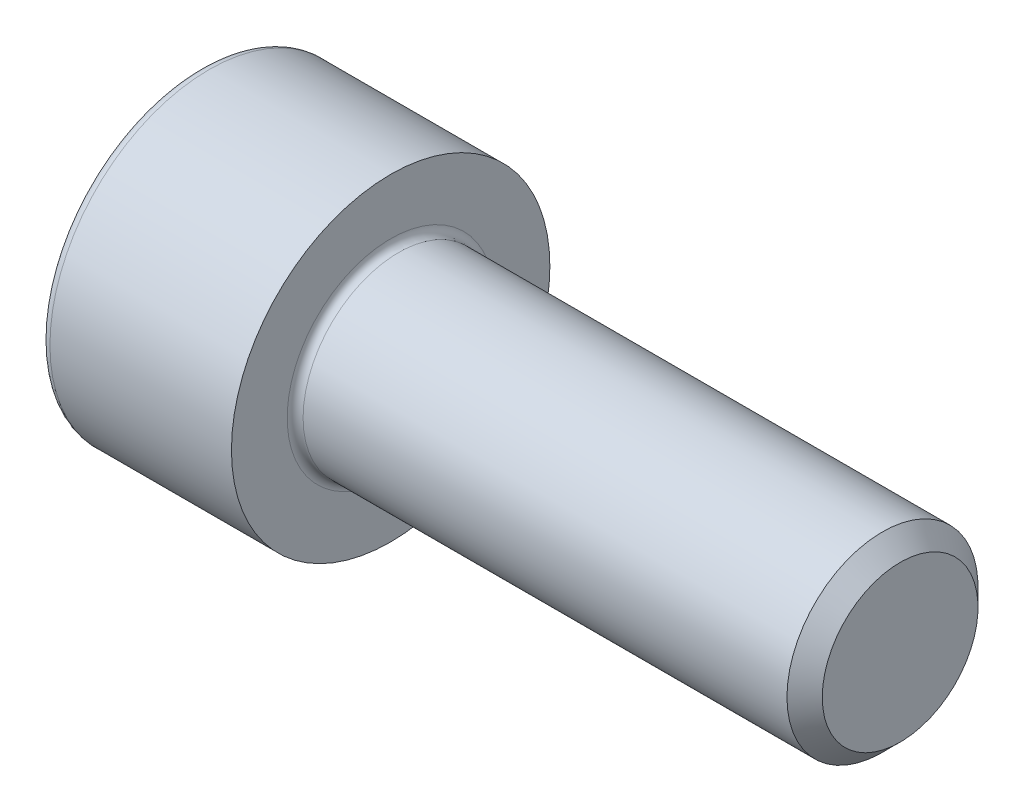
from build123d import *

# Parameters (mm, degrees)
FILLET1_R   = 0.25
FILLET2_R   = 0.3
HEX_2_DEPTH = 3


with BuildPart() as part:
    # BodySke → Base-Revolve (revolve)
    with BuildSketch(Plane.XY, mode=Mode.PRIVATE) as base_revolve_sk:
        Polygon((0, 0), (0, 5), (6, 5), (6, 3), (21.4455, 3), (22, 2.4455), (22, 0), align=None)
    revolve(base_revolve_sk.sketch.rotate(Axis((-31.75, 0, 0), (1, 0, 0)), 90), axis=Axis((-31.75, 0, 0), (1, 0, 0)))

    # Fillet1
    fillet1_edges = [part.edges().sort_by_distance(p)[0] for p in [
        (6, 0, -3),
    ]]
    fillet(fillet1_edges, radius=FILLET1_R)

    # Fillet2
    fillet2_edges = [part.edges().sort_by_distance(p)[0] for p in [
        (0, 0, -5),
    ]]
    fillet(fillet2_edges, radius=FILLET2_R)

    # Sketch2 → Hex-PreBroach (revolve, cut)
    with BuildSketch(Plane.XY, mode=Mode.PRIVATE) as hex_prebroach_sk:
        Polygon((0, 2.542), (3, 2.542), (4.467624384, 0), (0, 0), align=None)
    revolve(hex_prebroach_sk.sketch.rotate(Axis((0, 0, 0), (1, 0, 0)), 90), axis=Axis((0, 0, 0), (1, 0, 0)), mode=Mode.SUBTRACT)

    # Sketch3 → Hex 2 (cut)
    with BuildSketch(Plane(origin=(0, 0, 0), x_dir=(0, 0.500000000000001, 0.866025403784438), z_dir=(-1, 0, 0))):
        Polygon((1.467624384, 2.542), (-1.467624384, 2.542), (-2.935248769, 0), (-1.467624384, -2.542), (1.467624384, -2.542), (2.935248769, 0), align=None)
    extrude(amount=-HEX_2_DEPTH, mode=Mode.SUBTRACT)


solid = part.part
